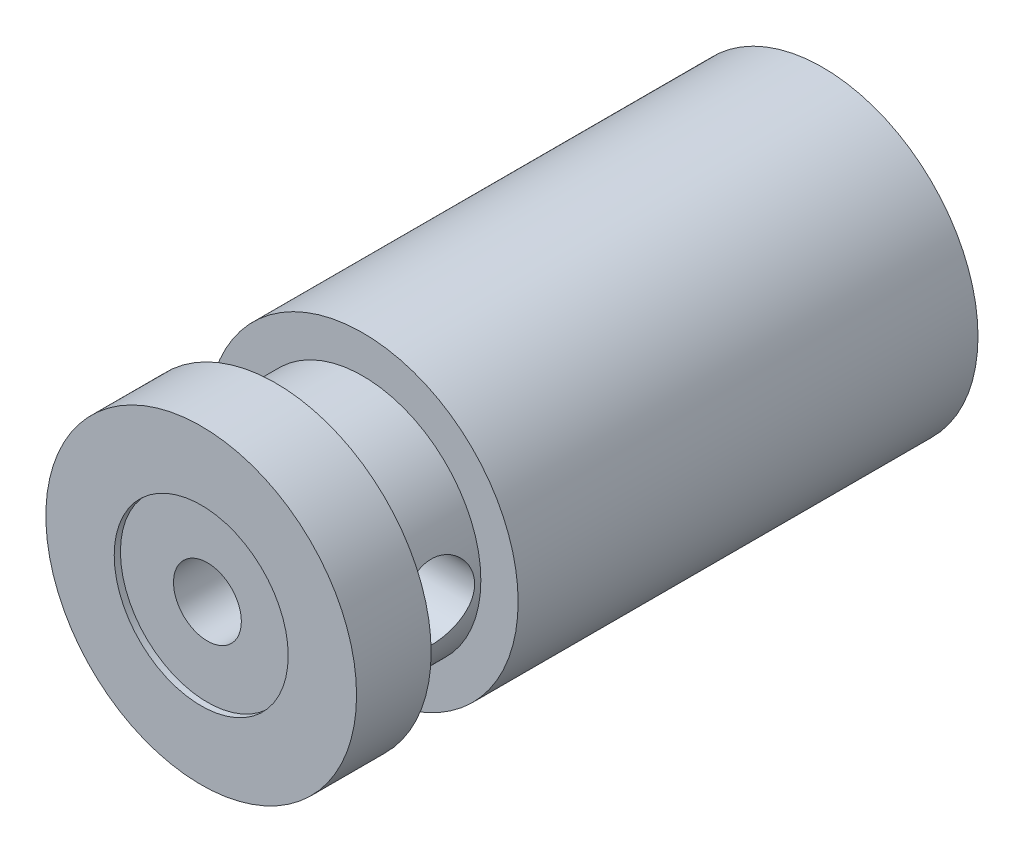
ISO-10303-21;
HEADER;
FILE_DESCRIPTION(('STEP AP214'),'2;1');
FILE_NAME('part.step','',(''),(''),'','','');
FILE_SCHEMA(('AUTOMOTIVE_DESIGN { 1 0 10303 214 1 1 1 1 }'));
ENDSEC;
DATA;
#1=APPLICATION_CONTEXT('core data for automotive mechanical design processes');
#2=APPLICATION_PROTOCOL_DEFINITION('international standard','automotive_design',2000,#1);
#3=PRODUCT_CONTEXT('',#1,'mechanical');
#4=PRODUCT('Part','Part','',(#3));
#5=PRODUCT_RELATED_PRODUCT_CATEGORY('part','',(#4));
#6=PRODUCT_DEFINITION_FORMATION('','',#4);
#7=PRODUCT_DEFINITION_CONTEXT('part definition',#1,'design');
#8=PRODUCT_DEFINITION('design','',#6,#7);
#9=PRODUCT_DEFINITION_SHAPE('','',#8);
#10=(LENGTH_UNIT() NAMED_UNIT(*) SI_UNIT(.MILLI.,.METRE.));
#11=(NAMED_UNIT(*) PLANE_ANGLE_UNIT() SI_UNIT($,.RADIAN.));
#12=(NAMED_UNIT(*) SI_UNIT($,.STERADIAN.) SOLID_ANGLE_UNIT());
#13=UNCERTAINTY_MEASURE_WITH_UNIT(LENGTH_MEASURE(1.E-05),#10,'distance_accuracy_value','');
#14=(GEOMETRIC_REPRESENTATION_CONTEXT(3) GLOBAL_UNCERTAINTY_ASSIGNED_CONTEXT((#13)) GLOBAL_UNIT_ASSIGNED_CONTEXT((#10,
#11,#12)) REPRESENTATION_CONTEXT('',''));
#15=CARTESIAN_POINT('',(0.,0.,0.));
#16=DIRECTION('',(0.,0.,1.));
#17=DIRECTION('',(1.,0.,0.));
#18=AXIS2_PLACEMENT_3D('',#15,#16,#17);
#19=CARTESIAN_POINT('',(0.,0.,50.));
#20=DIRECTION('',(0.,0.,-1.));
#21=DIRECTION('',(-1.,0.,0.));
#22=AXIS2_PLACEMENT_3D('',#19,#20,#21);
#23=CYLINDRICAL_SURFACE('',#22,7.);
#24=CARTESIAN_POINT('',(0.,0.,49.5));
#25=DIRECTION('',(0.,0.,-1.));
#26=DIRECTION('',(-1.,0.,0.));
#27=AXIS2_PLACEMENT_3D('',#24,#25,#26);
#28=CIRCLE('',#27,7.);
#29=CARTESIAN_POINT('',(-7.,0.,49.5));
#30=VERTEX_POINT('',#29);
#31=EDGE_CURVE('E170',#30,#30,#28,.T.);
#32=ORIENTED_EDGE('',*,*,#31,.T.);
#33=EDGE_LOOP('',(#32));
#34=FACE_BOUND('',#33,.T.);
#35=CARTESIAN_POINT('',(0.,0.,50.));
#36=DIRECTION('',(0.,0.,-1.));
#37=DIRECTION('',(-1.,0.,0.));
#38=AXIS2_PLACEMENT_3D('',#35,#36,#37);
#39=CIRCLE('',#38,7.);
#40=CARTESIAN_POINT('',(-7.,0.,50.));
#41=VERTEX_POINT('',#40);
#42=EDGE_CURVE('E20',#41,#41,#39,.F.);
#43=ORIENTED_EDGE('',*,*,#42,.T.);
#44=EDGE_LOOP('',(#43));
#45=FACE_BOUND('',#44,.T.);
#46=ADVANCED_FACE('F16',(#34,#45),#23,.F.);
#47=CARTESIAN_POINT('',(0.,0.,8.0000000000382));
#48=DIRECTION('',(0.,0.,-1.));
#49=DIRECTION('',(-1.,0.,0.));
#50=AXIS2_PLACEMENT_3D('',#47,#48,#49);
#51=CONICAL_SURFACE('',#50,1.62099999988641,1.0297442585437);
#52=CARTESIAN_POINT('',(0.,0.,8.));
#53=DIRECTION('',(0.,0.,-1.));
#54=DIRECTION('',(-1.,0.,0.));
#55=AXIS2_PLACEMENT_3D('',#52,#53,#54);
#56=CIRCLE('',#55,1.621);
#57=CARTESIAN_POINT('',(-1.621,0.,8.));
#58=VERTEX_POINT('',#57);
#59=EDGE_CURVE('E169',#58,#58,#56,.T.);
#60=ORIENTED_EDGE('',*,*,#59,.T.);
#61=EDGE_LOOP('',(#60));
#62=FACE_BOUND('',#61,.T.);
#63=CARTESIAN_POINT('',(-5.6843418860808E-11,0.,8.97399506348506));
#64=VERTEX_POINT('',#63);
#65=VERTEX_LOOP('',#64);
#66=FACE_BOUND('',#65,.T.);
#67=ADVANCED_FACE('F53',(#62,#66),#51,.F.);
#68=CARTESIAN_POINT('',(0.,0.,50.));
#69=DIRECTION('',(0.,0.,-1.));
#70=DIRECTION('',(-1.,0.,0.));
#71=AXIS2_PLACEMENT_3D('',#68,#69,#70);
#72=PLANE('',#71);
#73=CARTESIAN_POINT('',(0.,0.,50.));
#74=DIRECTION('',(0.,0.,1.));
#75=DIRECTION('',(1.,0.,0.));
#76=AXIS2_PLACEMENT_3D('',#73,#74,#75);
#77=CIRCLE('',#76,12.5);
#78=CARTESIAN_POINT('',(12.5,0.,50.));
#79=VERTEX_POINT('',#78);
#80=EDGE_CURVE('E167',#79,#79,#77,.F.);
#81=ORIENTED_EDGE('',*,*,#80,.F.);
#82=EDGE_LOOP('',(#81));
#83=FACE_BOUND('',#82,.T.);
#84=ORIENTED_EDGE('',*,*,#42,.F.);
#85=EDGE_LOOP('',(#84));
#86=FACE_BOUND('',#85,.T.);
#87=ADVANCED_FACE('F55',(#83,#86),#72,.F.);
#88=CARTESIAN_POINT('',(0.,0.,49.5));
#89=DIRECTION('',(0.,0.,-1.));
#90=DIRECTION('',(-1.,0.,0.));
#91=AXIS2_PLACEMENT_3D('',#88,#89,#90);
#92=PLANE('',#91);
#93=ORIENTED_EDGE('',*,*,#31,.F.);
#94=EDGE_LOOP('',(#93));
#95=FACE_BOUND('',#94,.T.);
#96=CARTESIAN_POINT('',(0.,0.,49.5));
#97=DIRECTION('',(0.,0.,1.));
#98=DIRECTION('',(1.,0.,0.));
#99=AXIS2_PLACEMENT_3D('',#96,#97,#98);
#100=CIRCLE('',#99,2.7295);
#101=CARTESIAN_POINT('',(2.7295,0.,49.5));
#102=VERTEX_POINT('',#101);
#103=EDGE_CURVE('E164',#102,#102,#100,.F.);
#104=ORIENTED_EDGE('',*,*,#103,.T.);
#105=EDGE_LOOP('',(#104));
#106=FACE_BOUND('',#105,.T.);
#107=ADVANCED_FACE('F61',(#95,#106),#92,.F.);
#108=CARTESIAN_POINT('',(0.,0.,4.25));
#109=DIRECTION('',(0.,0.,-1.));
#110=DIRECTION('',(-1.,0.,0.));
#111=AXIS2_PLACEMENT_3D('',#108,#109,#110);
#112=CYLINDRICAL_SURFACE('',#111,1.621);
#113=ORIENTED_EDGE('',*,*,#59,.F.);
#114=EDGE_LOOP('',(#113));
#115=FACE_BOUND('',#114,.T.);
#116=CARTESIAN_POINT('',(0.,0.,0.5));
#117=DIRECTION('',(0.,0.,-1.));
#118=DIRECTION('',(-1.,0.,0.));
#119=AXIS2_PLACEMENT_3D('',#116,#117,#118);
#120=CIRCLE('',#119,1.621);
#121=CARTESIAN_POINT('',(-1.621,0.,0.5));
#122=VERTEX_POINT('',#121);
#123=EDGE_CURVE('E153',#122,#122,#120,.T.);
#124=ORIENTED_EDGE('',*,*,#123,.T.);
#125=EDGE_LOOP('',(#124));
#126=FACE_BOUND('',#125,.T.);
#127=ADVANCED_FACE('F191',(#115,#126),#112,.F.);
#128=CARTESIAN_POINT('',(0.,0.,44.));
#129=DIRECTION('',(0.,0.,1.));
#130=DIRECTION('',(1.,0.,0.));
#131=AXIS2_PLACEMENT_3D('',#128,#129,#130);
#132=CYLINDRICAL_SURFACE('',#131,12.5);
#133=ORIENTED_EDGE('',*,*,#80,.T.);
#134=EDGE_LOOP('',(#133));
#135=FACE_BOUND('',#134,.T.);
#136=CARTESIAN_POINT('',(0.,0.,44.));
#137=DIRECTION('',(0.,0.,1.));
#138=DIRECTION('',(1.,0.,0.));
#139=AXIS2_PLACEMENT_3D('',#136,#137,#138);
#140=CIRCLE('',#139,12.5);
#141=CARTESIAN_POINT('',(12.5,0.,44.));
#142=VERTEX_POINT('',#141);
#143=EDGE_CURVE('E151',#142,#142,#140,.F.);
#144=ORIENTED_EDGE('',*,*,#143,.F.);
#145=EDGE_LOOP('',(#144));
#146=FACE_BOUND('',#145,.T.);
#147=ADVANCED_FACE('F188',(#135,#146),#132,.T.);
#148=CARTESIAN_POINT('',(0.,0.,41.9999999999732));
#149=DIRECTION('',(0.,0.,1.));
#150=DIRECTION('',(1.,0.,0.));
#151=AXIS2_PLACEMENT_3D('',#148,#149,#150);
#152=CONICAL_SURFACE('',#151,2.72949999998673,1.02974425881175);
#153=CARTESIAN_POINT('',(0.,0.,42.));
#154=DIRECTION('',(0.,0.,1.));
#155=DIRECTION('',(1.,0.,0.));
#156=AXIS2_PLACEMENT_3D('',#153,#154,#155);
#157=CIRCLE('',#156,2.7295);
#158=CARTESIAN_POINT('',(-0.836761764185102,-2.5980762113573,41.9999999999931));
#159=VERTEX_POINT('',#158);
#160=CARTESIAN_POINT('',(0.83676176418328,-2.59807621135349,41.9999999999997));
#161=VERTEX_POINT('',#160);
#162=EDGE_CURVE('E44',#159,#161,#157,.T.);
#163=ORIENTED_EDGE('',*,*,#162,.T.);
#164=CARTESIAN_POINT('',(0.836761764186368,-2.5980762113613,41.9999999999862));
#165=CARTESIAN_POINT('',(0.775150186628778,-2.60300170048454,41.9914664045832));
#166=CARTESIAN_POINT('',(0.713379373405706,-2.60737971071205,41.9837892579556));
#167=CARTESIAN_POINT('',(0.589566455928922,-2.61504035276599,41.9702467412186));
#168=CARTESIAN_POINT('',(0.527524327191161,-2.61832288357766,41.9643815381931));
#169=CARTESIAN_POINT('',(0.341065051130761,-2.62652602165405,41.9496532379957));
#170=CARTESIAN_POINT('',(0.216328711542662,-2.62980108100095,41.9436593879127));
#171=CARTESIAN_POINT('',(-0.0319170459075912,-2.63193952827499,41.9397562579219));
#172=CARTESIAN_POINT('',(-0.155424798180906,-2.63085124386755,41.9417584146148));
#173=CARTESIAN_POINT('',(-0.40190739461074,-2.62437638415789,41.9535105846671));
#174=CARTESIAN_POINT('',(-0.524882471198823,-2.61899192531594,41.9632567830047));
#175=CARTESIAN_POINT('',(-0.678932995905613,-2.60952300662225,41.9800013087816));
#176=CARTESIAN_POINT('',(-0.710525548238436,-2.60743598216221,41.9836769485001));
#177=CARTESIAN_POINT('',(-0.773679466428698,-2.60297279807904,41.9914936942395));
#178=CARTESIAN_POINT('',(-0.805240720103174,-2.60059622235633,41.9956354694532));
#179=CARTESIAN_POINT('',(-0.836761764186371,-2.59807621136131,41.9999999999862));
#180=B_SPLINE_CURVE_WITH_KNOTS('',3,(#164,#165,#166,#167,#168,#169,#170,#171,#172,#173,#174,
#175,#176,#177,#178,#179),.UNSPECIFIED.,.F.,.F.,(4,2,2,2,2,2,2,4),(0.,0.187167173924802,
0.374351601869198,0.748761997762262,1.11903700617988,1.4891297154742,1.58474945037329,
1.68050825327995),.UNSPECIFIED.);
#181=EDGE_CURVE('E155',#161,#159,#180,.T.);
#182=ORIENTED_EDGE('',*,*,#181,.T.);
#183=EDGE_LOOP('',(#163,#182));
#184=FACE_BOUND('',#183,.T.);
#185=ADVANCED_FACE('F181',(#184),#152,.F.);
#186=CARTESIAN_POINT('',(0.,0.,45.75));
#187=DIRECTION('',(0.,0.,1.));
#188=DIRECTION('',(1.,0.,0.));
#189=AXIS2_PLACEMENT_3D('',#186,#187,#188);
#190=CYLINDRICAL_SURFACE('',#189,2.7295);
#191=ORIENTED_EDGE('',*,*,#103,.F.);
#192=EDGE_LOOP('',(#191));
#193=FACE_BOUND('',#192,.T.);
#194=ORIENTED_EDGE('',*,*,#162,.F.);
#195=CARTESIAN_POINT('',(-0.836761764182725,-2.59807621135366,41.9999999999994));
#196=CARTESIAN_POINT('',(-0.885633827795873,-2.58232501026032,42.0272993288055));
#197=CARTESIAN_POINT('',(-0.933521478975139,-2.5653903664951,42.0556216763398));
#198=CARTESIAN_POINT('',(-1.02747352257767,-2.52923224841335,42.1137347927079));
#199=CARTESIAN_POINT('',(-1.07353888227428,-2.51001001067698,42.1435247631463));
#200=CARTESIAN_POINT('',(-1.16404612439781,-2.46933676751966,42.2040274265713));
#201=CARTESIAN_POINT('',(-1.20848793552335,-2.44788566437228,42.234740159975));
#202=CARTESIAN_POINT('',(-1.29585841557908,-2.40277721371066,42.2967000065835));
#203=CARTESIAN_POINT('',(-1.33878684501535,-2.37911951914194,42.3279472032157));
#204=CARTESIAN_POINT('',(-1.4661870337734,-2.30439364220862,42.422565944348));
#205=CARTESIAN_POINT('',(-1.54846496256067,-2.24993734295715,42.4862597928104));
#206=CARTESIAN_POINT('',(-1.70724092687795,-2.13196408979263,42.6123911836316));
#207=CARTESIAN_POINT('',(-1.7837406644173,-2.06844982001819,42.6748290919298));
#208=CARTESIAN_POINT('',(-1.9098888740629,-1.95132422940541,42.7796159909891));
#209=CARTESIAN_POINT('',(-1.96103427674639,-1.89995774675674,42.8226725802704));
#210=CARTESIAN_POINT('',(-2.05981682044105,-1.79239075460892,42.906657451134));
#211=CARTESIAN_POINT('',(-2.10745444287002,-1.73619091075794,42.9475860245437));
#212=CARTESIAN_POINT('',(-2.24422333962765,-1.56062364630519,43.0659844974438));
#213=CARTESIAN_POINT('',(-2.32769368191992,-1.43384734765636,43.1394740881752));
#214=CARTESIAN_POINT('',(-2.45804831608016,-1.19266839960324,43.2552064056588));
#215=CARTESIAN_POINT('',(-2.50893601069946,-1.08200604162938,43.3007545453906));
#216=CARTESIAN_POINT('',(-2.59639195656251,-0.850947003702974,43.3793592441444));
#217=CARTESIAN_POINT('',(-2.63297571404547,-0.73056103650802,43.4124293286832));
#218=CARTESIAN_POINT('',(-2.6835885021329,-0.508596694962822,43.4582747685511));
#219=CARTESIAN_POINT('',(-2.70072164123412,-0.40829557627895,43.4738366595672));
#220=CARTESIAN_POINT('',(-2.72367978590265,-0.205341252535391,43.4947016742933));
#221=CARTESIAN_POINT('',(-2.72950558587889,-0.102688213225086,43.5000055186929));
#222=CARTESIAN_POINT('',(-2.7294931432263,0.126051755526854,43.4999932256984));
#223=CARTESIAN_POINT('',(-2.72069953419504,0.252156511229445,43.4919862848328));
#224=CARTESIAN_POINT('',(-2.68622166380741,0.50009626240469,43.4606699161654));
#225=CARTESIAN_POINT('',(-2.66052236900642,0.621927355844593,43.4373468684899));
#226=CARTESIAN_POINT('',(-2.59430160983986,0.857094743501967,43.3775042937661));
#227=CARTESIAN_POINT('',(-2.55387475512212,0.970479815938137,43.3410690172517));
#228=CARTESIAN_POINT('',(-2.46045331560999,1.18757370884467,43.2573955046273));
#229=CARTESIAN_POINT('',(-2.40745458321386,1.29127932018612,43.2101537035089));
#230=CARTESIAN_POINT('',(-2.26779005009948,1.5273825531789,43.0867421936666));
#231=CARTESIAN_POINT('',(-2.17612920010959,1.65471411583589,43.0065518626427));
#232=CARTESIAN_POINT('',(-1.97684067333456,1.88838097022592,42.8356044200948));
#233=CARTESIAN_POINT('',(-1.86916865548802,1.99465597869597,42.7448181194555));
#234=CARTESIAN_POINT('',(-1.69638490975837,2.13969079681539,42.6039071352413));
#235=CARTESIAN_POINT('',(-1.63610037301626,2.18611520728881,42.5555254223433));
#236=CARTESIAN_POINT('',(-1.51213781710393,2.27362439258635,42.4582910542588));
#237=CARTESIAN_POINT('',(-1.44846068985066,2.31471056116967,42.4094385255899));
#238=CARTESIAN_POINT('',(-1.31784765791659,2.39147889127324,42.3123595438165));
#239=CARTESIAN_POINT('',(-1.2509220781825,2.42717686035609,42.2641316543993));
#240=CARTESIAN_POINT('',(-1.11337091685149,2.49327023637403,42.16940884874));
#241=CARTESIAN_POINT('',(-1.04274834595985,2.5236698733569,42.1229125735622));
#242=CARTESIAN_POINT('',(-0.948194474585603,2.55961712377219,42.0648038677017));
#243=CARTESIAN_POINT('',(-0.926193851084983,2.56766210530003,42.0515614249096));
#244=CARTESIAN_POINT('',(-0.881787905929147,2.5832487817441,42.0254691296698));
#245=CARTESIAN_POINT('',(-0.859382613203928,2.59079051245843,42.0126192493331));
#246=CARTESIAN_POINT('',(-0.836761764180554,2.59807621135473,41.9999999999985));
#247=B_SPLINE_CURVE_WITH_KNOTS('',3,(#195,#196,#197,#198,#199,#200,#201,#202,#203,#204,#205,
#206,#207,#208,#209,#210,#211,#212,#213,#214,#215,#216,#217,#218,#219,#220,#221,#222,#223,#224,
#225,#226,#227,#228,#229,#230,#231,#232,#233,#234,#235,#236,#237,#238,#239,#240,#241,#242,#243,
#244,#245,#246),.UNSPECIFIED.,.F.,.F.,(4,2,2,2,2,2,2,2,2,2,2,2,2,2,2,2,2,2,2,2,2,2,2,2,2,4),(0.,
0.174392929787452,0.348692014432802,0.522998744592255,0.697332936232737,1.04912860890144,
1.40082025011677,1.65351743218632,1.90617986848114,2.40921711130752,2.79788189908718,
3.1861241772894,3.4938502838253,3.8015547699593,4.17926794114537,4.55731745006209,
4.93298000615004,5.30876667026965,5.83452094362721,6.36175932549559,6.63208387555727,
6.90233770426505,7.17178258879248,7.44101136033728,7.52173095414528,7.60244479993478),.UNSPECIFIED.);
#248=CARTESIAN_POINT('',(-0.83676176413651,2.59807621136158,41.9999999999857));
#249=VERTEX_POINT('',#248);
#250=EDGE_CURVE('E35',#159,#249,#247,.T.);
#251=ORIENTED_EDGE('',*,*,#250,.T.);
#252=CARTESIAN_POINT('',(0.,0.,41.9999999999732));
#253=DIRECTION('',(0.,0.,1.));
#254=DIRECTION('',(1.,0.,0.));
#255=AXIS2_PLACEMENT_3D('',#252,#253,#254);
#256=CIRCLE('',#255,2.72949999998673);
#257=CARTESIAN_POINT('',(0.836761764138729,2.59807621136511,41.9999999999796));
#258=VERTEX_POINT('',#257);
#259=EDGE_CURVE('E158',#249,#258,#256,.F.);
#260=ORIENTED_EDGE('',*,*,#259,.T.);
#261=CARTESIAN_POINT('',(0.836761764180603,2.59807621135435,41.9999999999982));
#262=CARTESIAN_POINT('',(0.885633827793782,2.58232501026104,42.0272993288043));
#263=CARTESIAN_POINT('',(0.933521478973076,2.56539036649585,42.0556216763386));
#264=CARTESIAN_POINT('',(1.02747352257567,2.52923224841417,42.1137347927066));
#265=CARTESIAN_POINT('',(1.0735388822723,2.51001001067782,42.1435247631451));
#266=CARTESIAN_POINT('',(1.16404612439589,2.46933676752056,42.20402742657));
#267=CARTESIAN_POINT('',(1.20848793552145,2.44788566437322,42.2347401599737));
#268=CARTESIAN_POINT('',(1.29585841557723,2.40277721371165,42.2967000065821));
#269=CARTESIAN_POINT('',(1.33878684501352,2.37911951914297,42.3279472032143));
#270=CARTESIAN_POINT('',(1.46618703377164,2.30439364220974,42.4225659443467));
#271=CARTESIAN_POINT('',(1.54846496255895,2.24993734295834,42.4862597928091));
#272=CARTESIAN_POINT('',(1.70724092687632,2.13196408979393,42.6123911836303));
#273=CARTESIAN_POINT('',(1.78374066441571,2.06844982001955,42.6748290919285));
#274=CARTESIAN_POINT('',(1.90988887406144,1.95132422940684,42.7796159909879));
#275=CARTESIAN_POINT('',(1.96103427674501,1.89995774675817,42.8226725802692));
#276=CARTESIAN_POINT('',(2.05981682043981,1.79239075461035,42.9066574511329));
#277=CARTESIAN_POINT('',(2.10745444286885,1.73619091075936,42.9475860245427));
#278=CARTESIAN_POINT('',(2.2442233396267,1.56062364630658,43.065984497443));
#279=CARTESIAN_POINT('',(2.32769368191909,1.43384734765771,43.1394740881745));
#280=CARTESIAN_POINT('',(2.45804831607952,1.19266839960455,43.2552064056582));
#281=CARTESIAN_POINT('',(2.50893601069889,1.0820060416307,43.3007545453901));
#282=CARTESIAN_POINT('',(2.59639195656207,0.850947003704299,43.379359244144));
#283=CARTESIAN_POINT('',(2.6329757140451,0.730561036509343,43.4124293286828));
#284=CARTESIAN_POINT('',(2.68358850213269,0.508596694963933,43.458274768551));
#285=CARTESIAN_POINT('',(2.70072164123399,0.408295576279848,43.4738366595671));
#286=CARTESIAN_POINT('',(2.72367978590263,0.205341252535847,43.4947016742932));
#287=CARTESIAN_POINT('',(2.72950558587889,0.102688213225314,43.5000055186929));
#288=CARTESIAN_POINT('',(2.7294931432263,-0.126051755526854,43.4999932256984));
#289=CARTESIAN_POINT('',(2.72069953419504,-0.252156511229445,43.4919862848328));
#290=CARTESIAN_POINT('',(2.68622166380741,-0.500096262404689,43.4606699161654));
#291=CARTESIAN_POINT('',(2.66052236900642,-0.621927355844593,43.4373468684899));
#292=CARTESIAN_POINT('',(2.59430160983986,-0.857094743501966,43.3775042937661));
#293=CARTESIAN_POINT('',(2.55387475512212,-0.970479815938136,43.3410690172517));
#294=CARTESIAN_POINT('',(2.46045331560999,-1.18757370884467,43.2573955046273));
#295=CARTESIAN_POINT('',(2.40745458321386,-1.29127932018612,43.2101537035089));
#296=CARTESIAN_POINT('',(2.26779005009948,-1.5273825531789,43.0867421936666));
#297=CARTESIAN_POINT('',(2.17612920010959,-1.65471411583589,43.0065518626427));
#298=CARTESIAN_POINT('',(1.97684067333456,-1.88838097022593,42.8356044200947));
#299=CARTESIAN_POINT('',(1.86916865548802,-1.99465597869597,42.7448181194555));
#300=CARTESIAN_POINT('',(1.69638490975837,-2.13969079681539,42.6039071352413));
#301=CARTESIAN_POINT('',(1.63610037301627,-2.18611520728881,42.5555254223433));
#302=CARTESIAN_POINT('',(1.51213781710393,-2.27362439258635,42.4582910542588));
#303=CARTESIAN_POINT('',(1.44846068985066,-2.31471056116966,42.4094385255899));
#304=CARTESIAN_POINT('',(1.31784765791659,-2.39147889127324,42.3123595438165));
#305=CARTESIAN_POINT('',(1.2509220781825,-2.42717686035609,42.2641316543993));
#306=CARTESIAN_POINT('',(1.1133709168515,-2.49327023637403,42.16940884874));
#307=CARTESIAN_POINT('',(1.04274834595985,-2.5236698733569,42.1229125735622));
#308=CARTESIAN_POINT('',(0.94819447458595,-2.55961712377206,42.0648038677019));
#309=CARTESIAN_POINT('',(0.926193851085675,-2.56766210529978,42.05156142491));
#310=CARTESIAN_POINT('',(0.881787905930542,-2.58324878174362,42.0254691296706));
#311=CARTESIAN_POINT('',(0.859382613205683,-2.59079051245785,42.0126192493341));
#312=CARTESIAN_POINT('',(0.836761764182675,-2.59807621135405,41.9999999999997));
#313=B_SPLINE_CURVE_WITH_KNOTS('',3,(#261,#262,#263,#264,#265,#266,#267,#268,#269,#270,#271,
#272,#273,#274,#275,#276,#277,#278,#279,#280,#281,#282,#283,#284,#285,#286,#287,#288,#289,#290,
#291,#292,#293,#294,#295,#296,#297,#298,#299,#300,#301,#302,#303,#304,#305,#306,#307,#308,#309,
#310,#311,#312),.UNSPECIFIED.,.F.,.F.,(4,2,2,2,2,2,2,2,2,2,2,2,2,2,2,2,2,2,2,2,2,2,2,2,2,4),(0.,
0.174392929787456,0.348692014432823,0.522998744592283,0.697332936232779,1.04912860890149,
1.40082025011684,1.65351743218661,1.90617986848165,2.40921711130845,2.79788189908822,
3.18612417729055,3.49385028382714,3.80155476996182,4.17926794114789,4.55731745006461,
4.93298000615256,5.30876667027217,5.83452094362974,6.36175932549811,6.63208387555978,
6.90233770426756,7.171782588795,7.44101136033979,7.52173095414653,7.60244479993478),.UNSPECIFIED.);
#314=EDGE_CURVE('E50',#258,#161,#313,.T.);
#315=ORIENTED_EDGE('',*,*,#314,.T.);
#316=EDGE_LOOP('',(#194,#251,#260,#315));
#317=FACE_BOUND('',#316,.T.);
#318=ADVANCED_FACE('F134',(#193,#317),#190,.F.);
#319=CARTESIAN_POINT('',(0.,0.,41.9999999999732));
#320=DIRECTION('',(0.,0.,1.));
#321=DIRECTION('',(1.,0.,0.));
#322=AXIS2_PLACEMENT_3D('',#319,#320,#321);
#323=CONICAL_SURFACE('',#322,2.72949999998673,1.02974425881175);
#324=ORIENTED_EDGE('',*,*,#259,.F.);
#325=CARTESIAN_POINT('',(-0.836761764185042,2.5980762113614,41.999999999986));
#326=CARTESIAN_POINT('',(-0.775150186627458,2.60300170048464,41.991466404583));
#327=CARTESIAN_POINT('',(-0.713379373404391,2.60737971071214,41.9837892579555));
#328=CARTESIAN_POINT('',(-0.589566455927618,2.61504035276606,41.9702467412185));
#329=CARTESIAN_POINT('',(-0.527524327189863,2.61832288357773,41.964381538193));
#330=CARTESIAN_POINT('',(-0.341065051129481,2.62652602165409,41.9496532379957));
#331=CARTESIAN_POINT('',(-0.216328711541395,2.62980108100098,41.9436593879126));
#332=CARTESIAN_POINT('',(0.0319170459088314,2.63193952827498,41.9397562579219));
#333=CARTESIAN_POINT('',(0.155424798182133,2.63085124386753,41.9417584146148));
#334=CARTESIAN_POINT('',(0.40190739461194,2.62437638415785,41.9535105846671));
#335=CARTESIAN_POINT('',(0.524882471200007,2.61899192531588,41.9632567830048));
#336=CARTESIAN_POINT('',(0.678932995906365,2.6095230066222,41.9800013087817));
#337=CARTESIAN_POINT('',(0.710525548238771,2.60743598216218,41.9836769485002));
#338=CARTESIAN_POINT('',(0.773679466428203,2.60297279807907,41.9914936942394));
#339=CARTESIAN_POINT('',(0.805240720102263,2.6005962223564,41.9956354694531));
#340=CARTESIAN_POINT('',(0.836761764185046,2.59807621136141,41.999999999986));
#341=B_SPLINE_CURVE_WITH_KNOTS('',3,(#325,#326,#327,#328,#329,#330,#331,#332,#333,#334,#335,
#336,#337,#338,#339,#340),.UNSPECIFIED.,.F.,.F.,(4,2,2,2,2,2,2,4),(0.,0.18716717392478,
0.374351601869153,0.748761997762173,1.11903700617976,1.48912971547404,1.58474945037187,
1.68050825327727),.UNSPECIFIED.);
#342=EDGE_CURVE('E117',#249,#258,#341,.T.);
#343=ORIENTED_EDGE('',*,*,#342,.T.);
#344=EDGE_LOOP('',(#324,#343));
#345=FACE_BOUND('',#344,.T.);
#346=ADVANCED_FACE('F129',(#345),#323,.F.);
#347=CARTESIAN_POINT('',(0.,0.,0.5));
#348=DIRECTION('',(0.,0.,1.));
#349=DIRECTION('',(1.,0.,0.));
#350=AXIS2_PLACEMENT_3D('',#347,#348,#349);
#351=PLANE('',#350);
#352=CARTESIAN_POINT('',(0.,0.,0.5));
#353=DIRECTION('',(0.,0.,1.));
#354=DIRECTION('',(1.,0.,0.));
#355=AXIS2_PLACEMENT_3D('',#352,#353,#354);
#356=CIRCLE('',#355,7.);
#357=CARTESIAN_POINT('',(7.,0.,0.5));
#358=VERTEX_POINT('',#357);
#359=EDGE_CURVE('E114',#358,#358,#356,.F.);
#360=ORIENTED_EDGE('',*,*,#359,.T.);
#361=EDGE_LOOP('',(#360));
#362=FACE_BOUND('',#361,.T.);
#363=ORIENTED_EDGE('',*,*,#123,.F.);
#364=EDGE_LOOP('',(#363));
#365=FACE_BOUND('',#364,.T.);
#366=ADVANCED_FACE('F133',(#362,#365),#351,.F.);
#367=CARTESIAN_POINT('',(0.,0.,44.));
#368=DIRECTION('',(0.,0.,-1.));
#369=DIRECTION('',(-1.,0.,0.));
#370=AXIS2_PLACEMENT_3D('',#367,#368,#369);
#371=PLANE('',#370);
#372=CARTESIAN_POINT('',(0.,0.,44.));
#373=DIRECTION('',(0.,0.,1.));
#374=DIRECTION('',(1.,0.,0.));
#375=AXIS2_PLACEMENT_3D('',#372,#373,#374);
#376=CIRCLE('',#375,9.5);
#377=CARTESIAN_POINT('',(9.5,0.,44.));
#378=VERTEX_POINT('',#377);
#379=EDGE_CURVE('E97',#378,#378,#376,.F.);
#380=ORIENTED_EDGE('',*,*,#379,.F.);
#381=EDGE_LOOP('',(#380));
#382=FACE_BOUND('',#381,.T.);
#383=ORIENTED_EDGE('',*,*,#143,.T.);
#384=EDGE_LOOP('',(#383));
#385=FACE_BOUND('',#384,.T.);
#386=ADVANCED_FACE('F139',(#382,#385),#371,.T.);
#387=CARTESIAN_POINT('',(0.,0.,40.5));
#388=DIRECTION('',(1.,0.,0.));
#389=DIRECTION('',(0.,0.,-1.));
#390=AXIS2_PLACEMENT_3D('',#387,#388,#389);
#391=CYLINDRICAL_SURFACE('',#390,3.);
#392=CARTESIAN_POINT('',(9.5,0.,37.5));
#393=CARTESIAN_POINT('',(9.49999511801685,-0.164066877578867,37.5000069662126));
#394=CARTESIAN_POINT('',(9.495706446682,-0.328218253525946,37.5135120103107));
#395=CARTESIAN_POINT('',(9.47900260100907,-0.651790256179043,37.5670637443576));
#396=CARTESIAN_POINT('',(9.46658016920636,-0.811206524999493,37.6071341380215));
#397=CARTESIAN_POINT('',(9.43496933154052,-1.12048354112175,37.7123224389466));
#398=CARTESIAN_POINT('',(9.4157933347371,-1.27036122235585,37.7773944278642));
#399=CARTESIAN_POINT('',(9.37265359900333,-1.5570513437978,37.9305607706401));
#400=CARTESIAN_POINT('',(9.34868981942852,-1.69386367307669,38.0186553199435));
#401=CARTESIAN_POINT('',(9.2976700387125,-1.95487292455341,38.2182844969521));
#402=CARTESIAN_POINT('',(9.27054565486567,-2.0786024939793,38.3304126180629));
#403=CARTESIAN_POINT('',(9.21664882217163,-2.30587471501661,38.5736919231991));
#404=CARTESIAN_POINT('',(9.189876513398,-2.40940954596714,38.704850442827));
#405=CARTESIAN_POINT('',(9.1389734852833,-2.59591411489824,38.9865617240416));
#406=CARTESIAN_POINT('',(9.11492840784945,-2.67828649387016,39.1375265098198));
#407=CARTESIAN_POINT('',(9.07327060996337,-2.81620314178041,39.4519582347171));
#408=CARTESIAN_POINT('',(9.05565003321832,-2.87178020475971,39.6154096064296));
#409=CARTESIAN_POINT('',(9.03308955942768,-2.94179842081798,39.8996827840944));
#410=CARTESIAN_POINT('',(9.02593084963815,-2.96358011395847,40.018570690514));
#411=CARTESIAN_POINT('',(9.01632316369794,-2.9926829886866,40.2582904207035));
#412=CARTESIAN_POINT('',(9.01387382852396,-3.00000527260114,40.3791220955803));
#413=CARTESIAN_POINT('',(9.01388409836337,-2.99999285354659,40.6638372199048));
#414=CARTESIAN_POINT('',(9.0183976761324,-2.98652429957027,40.8277593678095));
#415=CARTESIAN_POINT('',(9.03590055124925,-2.9331307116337,41.150854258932));
#416=CARTESIAN_POINT('',(9.04889770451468,-2.89318115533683,41.3100224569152));
#417=CARTESIAN_POINT('',(9.08174630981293,-2.78834572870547,41.6187731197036));
#418=CARTESIAN_POINT('',(9.10158363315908,-2.72351122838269,41.7683745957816));
#419=CARTESIAN_POINT('',(9.14585867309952,-2.57090557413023,42.0545938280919));
#420=CARTESIAN_POINT('',(9.17029653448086,-2.48313369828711,42.191211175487));
#421=CARTESIAN_POINT('',(9.22198214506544,-2.2838458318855,42.452404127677));
#422=CARTESIAN_POINT('',(9.24929453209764,-2.17166359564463,42.5764587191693));
#423=CARTESIAN_POINT('',(9.30310821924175,-1.92813544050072,42.8043685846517));
#424=CARTESIAN_POINT('',(9.3296092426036,-1.7967830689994,42.9082170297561));
#425=CARTESIAN_POINT('',(9.37955934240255,-1.51486622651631,43.0950813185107));
#426=CARTESIAN_POINT('',(9.40292193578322,-1.36392242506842,43.177549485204));
#427=CARTESIAN_POINT('',(9.44317138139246,-1.0495329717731,43.3156493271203));
#428=CARTESIAN_POINT('',(9.46006588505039,-0.886102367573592,43.3713127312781));
#429=CARTESIAN_POINT('',(9.48166494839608,-0.601608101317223,43.4415465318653));
#430=CARTESIAN_POINT('',(9.48850284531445,-0.482459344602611,43.463423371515));
#431=CARTESIAN_POINT('',(9.49767203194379,-0.242222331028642,43.4926522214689));
#432=CARTESIAN_POINT('',(9.50000360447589,-0.121134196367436,43.5000051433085));
#433=CARTESIAN_POINT('',(9.49999511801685,0.164066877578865,43.4999930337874));
#434=CARTESIAN_POINT('',(9.495706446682,0.328218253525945,43.4864879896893));
#435=CARTESIAN_POINT('',(9.47900260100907,0.651790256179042,43.4329362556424));
#436=CARTESIAN_POINT('',(9.46658016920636,0.811206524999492,43.3928658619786));
#437=CARTESIAN_POINT('',(9.43496933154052,1.12048354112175,43.2876775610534));
#438=CARTESIAN_POINT('',(9.4157933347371,1.27036122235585,43.2226055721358));
#439=CARTESIAN_POINT('',(9.37265359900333,1.5570513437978,43.0694392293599));
#440=CARTESIAN_POINT('',(9.34868981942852,1.69386367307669,42.9813446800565));
#441=CARTESIAN_POINT('',(9.2976700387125,1.95487292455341,42.7817155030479));
#442=CARTESIAN_POINT('',(9.27054565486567,2.07860249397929,42.6695873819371));
#443=CARTESIAN_POINT('',(9.21664882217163,2.30587471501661,42.4263080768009));
#444=CARTESIAN_POINT('',(9.189876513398,2.40940954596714,42.295149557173));
#445=CARTESIAN_POINT('',(9.1389734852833,2.59591411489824,42.0134382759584));
#446=CARTESIAN_POINT('',(9.11492840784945,2.67828649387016,41.8624734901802));
#447=CARTESIAN_POINT('',(9.07327060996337,2.81620314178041,41.5480417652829));
#448=CARTESIAN_POINT('',(9.05565003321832,2.87178020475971,41.3845903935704));
#449=CARTESIAN_POINT('',(9.03308955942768,2.94179842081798,41.1003172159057));
#450=CARTESIAN_POINT('',(9.02593084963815,2.96358011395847,40.981429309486));
#451=CARTESIAN_POINT('',(9.01632316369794,2.9926829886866,40.7417095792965));
#452=CARTESIAN_POINT('',(9.01387382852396,3.00000527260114,40.6208779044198));
#453=CARTESIAN_POINT('',(9.01388409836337,2.99999285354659,40.3361627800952));
#454=CARTESIAN_POINT('',(9.0183976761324,2.98652429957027,40.1722406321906));
#455=CARTESIAN_POINT('',(9.03590055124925,2.9331307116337,39.849145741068));
#456=CARTESIAN_POINT('',(9.04889770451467,2.89318115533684,39.6899775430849));
#457=CARTESIAN_POINT('',(9.08174630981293,2.78834572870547,39.3812268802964));
#458=CARTESIAN_POINT('',(9.10158363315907,2.7235112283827,39.2316254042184));
#459=CARTESIAN_POINT('',(9.14585867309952,2.57090557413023,38.9454061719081));
#460=CARTESIAN_POINT('',(9.17029653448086,2.48313369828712,38.808788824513));
#461=CARTESIAN_POINT('',(9.22198214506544,2.28384583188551,38.547595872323));
#462=CARTESIAN_POINT('',(9.24929453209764,2.17166359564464,38.4235412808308));
#463=CARTESIAN_POINT('',(9.30310821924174,1.92813544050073,38.1956314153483));
#464=CARTESIAN_POINT('',(9.32960924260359,1.79678306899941,38.0917829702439));
#465=CARTESIAN_POINT('',(9.37955934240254,1.51486622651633,37.9049186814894));
#466=CARTESIAN_POINT('',(9.40292193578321,1.36392242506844,37.822450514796));
#467=CARTESIAN_POINT('',(9.44317138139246,1.04953297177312,37.6843506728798));
#468=CARTESIAN_POINT('',(9.46006588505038,0.886102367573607,37.6286872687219));
#469=CARTESIAN_POINT('',(9.48166494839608,0.601608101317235,37.5584534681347));
#470=CARTESIAN_POINT('',(9.48850284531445,0.482459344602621,37.536576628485));
#471=CARTESIAN_POINT('',(9.49767203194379,0.242222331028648,37.5073477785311));
#472=CARTESIAN_POINT('',(9.50000360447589,0.121134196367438,37.4999948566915));
#473=CARTESIAN_POINT('',(9.5,0.,37.5));
#474=B_SPLINE_CURVE_WITH_KNOTS('',3,(#392,#393,#394,#395,#396,#397,#398,#399,#400,#401,#402,
#403,#404,#405,#406,#407,#408,#409,#410,#411,#412,#413,#414,#415,#416,#417,#418,#419,#420,#421,
#422,#423,#424,#425,#426,#427,#428,#429,#430,#431,#432,#433,#434,#435,#436,#437,#438,#439,#440,
#441,#442,#443,#444,#445,#446,#447,#448,#449,#450,#451,#452,#453,#454,#455,#456,#457,#458,#459,
#460,#461,#462,#463,#464,#465,#466,#467,#468,#469,#470,#471,#472,#473),.UNSPECIFIED.,.T.,.F.,(4,
2,2,2,2,2,2,2,2,2,2,2,2,2,2,2,2,2,2,2,2,2,2,2,2,2,2,2,2,2,2,2,2,2,2,2,2,2,2,2,4),(0.,
0.491747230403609,0.983933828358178,1.4752207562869,1.96651185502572,2.47172495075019,
2.97713330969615,3.49553949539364,4.01330959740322,4.37563531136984,4.73793340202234,
5.22899016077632,5.72050229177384,6.21100520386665,6.70152355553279,7.20763880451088,
7.71392480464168,8.2321234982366,8.74970728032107,9.11279790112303,9.47586573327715,
9.96761296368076,10.4597995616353,10.951086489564,11.4423775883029,11.9475906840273,
12.4529990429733,12.9714052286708,13.4891753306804,13.851501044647,14.2137991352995,
14.7048558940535,15.196368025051,15.6868709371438,16.1773892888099,16.683504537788,
17.1897905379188,17.7079892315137,18.2255730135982,18.5886636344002,18.9517314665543),.UNSPECIFIED.);
#475=CARTESIAN_POINT('',(9.5,0.,37.5));
#476=VERTEX_POINT('',#475);
#477=EDGE_CURVE('E109',#476,#476,#474,.T.);
#478=ORIENTED_EDGE('',*,*,#477,.F.);
#479=EDGE_LOOP('',(#478));
#480=FACE_BOUND('',#479,.T.);
#481=CARTESIAN_POINT('',(-9.01387818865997,3.,40.5));
#482=CARTESIAN_POINT('',(-9.01388409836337,2.99999285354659,40.6638372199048));
#483=CARTESIAN_POINT('',(-9.0183976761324,2.98652429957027,40.8277593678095));
#484=CARTESIAN_POINT('',(-9.03590055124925,2.9331307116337,41.150854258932));
#485=CARTESIAN_POINT('',(-9.04889770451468,2.89318115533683,41.3100224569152));
#486=CARTESIAN_POINT('',(-9.08174630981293,2.78834572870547,41.6187731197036));
#487=CARTESIAN_POINT('',(-9.10158363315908,2.72351122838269,41.7683745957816));
#488=CARTESIAN_POINT('',(-9.14585867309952,2.57090557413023,42.0545938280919));
#489=CARTESIAN_POINT('',(-9.17029653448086,2.48313369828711,42.191211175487));
#490=CARTESIAN_POINT('',(-9.22198214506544,2.2838458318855,42.452404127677));
#491=CARTESIAN_POINT('',(-9.24929453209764,2.17166359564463,42.5764587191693));
#492=CARTESIAN_POINT('',(-9.30310821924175,1.92813544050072,42.8043685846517));
#493=CARTESIAN_POINT('',(-9.3296092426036,1.7967830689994,42.9082170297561));
#494=CARTESIAN_POINT('',(-9.37955934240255,1.51486622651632,43.0950813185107));
#495=CARTESIAN_POINT('',(-9.40292193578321,1.36392242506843,43.177549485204));
#496=CARTESIAN_POINT('',(-9.44317138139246,1.0495329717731,43.3156493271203));
#497=CARTESIAN_POINT('',(-9.46006588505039,0.886102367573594,43.3713127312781));
#498=CARTESIAN_POINT('',(-9.48166494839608,0.601608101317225,43.4415465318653));
#499=CARTESIAN_POINT('',(-9.48850284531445,0.482459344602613,43.463423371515));
#500=CARTESIAN_POINT('',(-9.49767203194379,0.242222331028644,43.4926522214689));
#501=CARTESIAN_POINT('',(-9.50000360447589,0.121134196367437,43.5000051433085));
#502=CARTESIAN_POINT('',(-9.49999511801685,-0.164066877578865,43.4999930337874));
#503=CARTESIAN_POINT('',(-9.495706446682,-0.328218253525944,43.4864879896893));
#504=CARTESIAN_POINT('',(-9.47900260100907,-0.651790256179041,43.4329362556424));
#505=CARTESIAN_POINT('',(-9.46658016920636,-0.811206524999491,43.3928658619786));
#506=CARTESIAN_POINT('',(-9.43496933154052,-1.12048354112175,43.2876775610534));
#507=CARTESIAN_POINT('',(-9.4157933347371,-1.27036122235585,43.2226055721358));
#508=CARTESIAN_POINT('',(-9.37265359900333,-1.5570513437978,43.0694392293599));
#509=CARTESIAN_POINT('',(-9.34868981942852,-1.69386367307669,42.9813446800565));
#510=CARTESIAN_POINT('',(-9.2976700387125,-1.95487292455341,42.7817155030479));
#511=CARTESIAN_POINT('',(-9.27054565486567,-2.07860249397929,42.6695873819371));
#512=CARTESIAN_POINT('',(-9.21664882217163,-2.30587471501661,42.4263080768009));
#513=CARTESIAN_POINT('',(-9.189876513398,-2.40940954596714,42.295149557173));
#514=CARTESIAN_POINT('',(-9.13897348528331,-2.59591411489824,42.0134382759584));
#515=CARTESIAN_POINT('',(-9.11492840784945,-2.67828649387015,41.8624734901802));
#516=CARTESIAN_POINT('',(-9.07327060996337,-2.81620314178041,41.5480417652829));
#517=CARTESIAN_POINT('',(-9.05565003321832,-2.8717802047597,41.3845903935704));
#518=CARTESIAN_POINT('',(-9.03308955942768,-2.94179842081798,41.1003172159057));
#519=CARTESIAN_POINT('',(-9.02593084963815,-2.96358011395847,40.981429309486));
#520=CARTESIAN_POINT('',(-9.01632316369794,-2.9926829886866,40.7417095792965));
#521=CARTESIAN_POINT('',(-9.01387382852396,-3.00000527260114,40.6208779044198));
#522=CARTESIAN_POINT('',(-9.01388409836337,-2.99999285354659,40.3361627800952));
#523=CARTESIAN_POINT('',(-9.0183976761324,-2.98652429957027,40.1722406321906));
#524=CARTESIAN_POINT('',(-9.03590055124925,-2.9331307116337,39.849145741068));
#525=CARTESIAN_POINT('',(-9.04889770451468,-2.89318115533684,39.6899775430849));
#526=CARTESIAN_POINT('',(-9.08174630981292,-2.78834572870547,39.3812268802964));
#527=CARTESIAN_POINT('',(-9.10158363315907,-2.7235112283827,39.2316254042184));
#528=CARTESIAN_POINT('',(-9.14585867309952,-2.57090557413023,38.9454061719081));
#529=CARTESIAN_POINT('',(-9.17029653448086,-2.48313369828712,38.808788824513));
#530=CARTESIAN_POINT('',(-9.22198214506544,-2.28384583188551,38.547595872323));
#531=CARTESIAN_POINT('',(-9.24929453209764,-2.17166359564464,38.4235412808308));
#532=CARTESIAN_POINT('',(-9.30310821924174,-1.92813544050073,38.1956314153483));
#533=CARTESIAN_POINT('',(-9.32960924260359,-1.79678306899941,38.0917829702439));
#534=CARTESIAN_POINT('',(-9.37955934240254,-1.51486622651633,37.9049186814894));
#535=CARTESIAN_POINT('',(-9.40292193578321,-1.36392242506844,37.822450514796));
#536=CARTESIAN_POINT('',(-9.44317138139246,-1.04953297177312,37.6843506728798));
#537=CARTESIAN_POINT('',(-9.46006588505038,-0.886102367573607,37.6286872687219));
#538=CARTESIAN_POINT('',(-9.48166494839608,-0.601608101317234,37.5584534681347));
#539=CARTESIAN_POINT('',(-9.48850284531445,-0.48245934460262,37.536576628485));
#540=CARTESIAN_POINT('',(-9.49767203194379,-0.242222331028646,37.5073477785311));
#541=CARTESIAN_POINT('',(-9.50000360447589,-0.121134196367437,37.4999948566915));
#542=CARTESIAN_POINT('',(-9.49999511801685,0.164066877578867,37.5000069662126));
#543=CARTESIAN_POINT('',(-9.495706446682,0.328218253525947,37.5135120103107));
#544=CARTESIAN_POINT('',(-9.47900260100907,0.651790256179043,37.5670637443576));
#545=CARTESIAN_POINT('',(-9.46658016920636,0.811206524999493,37.6071341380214));
#546=CARTESIAN_POINT('',(-9.43496933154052,1.12048354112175,37.7123224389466));
#547=CARTESIAN_POINT('',(-9.4157933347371,1.27036122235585,37.7773944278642));
#548=CARTESIAN_POINT('',(-9.37265359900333,1.5570513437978,37.9305607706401));
#549=CARTESIAN_POINT('',(-9.34868981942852,1.69386367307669,38.0186553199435));
#550=CARTESIAN_POINT('',(-9.2976700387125,1.95487292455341,38.2182844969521));
#551=CARTESIAN_POINT('',(-9.27054565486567,2.07860249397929,38.3304126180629));
#552=CARTESIAN_POINT('',(-9.21664882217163,2.30587471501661,38.5736919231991));
#553=CARTESIAN_POINT('',(-9.189876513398,2.40940954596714,38.704850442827));
#554=CARTESIAN_POINT('',(-9.1389734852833,2.59591411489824,38.9865617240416));
#555=CARTESIAN_POINT('',(-9.11492840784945,2.67828649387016,39.1375265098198));
#556=CARTESIAN_POINT('',(-9.07327060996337,2.81620314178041,39.4519582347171));
#557=CARTESIAN_POINT('',(-9.05565003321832,2.87178020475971,39.6154096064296));
#558=CARTESIAN_POINT('',(-9.03308955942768,2.94179842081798,39.8996827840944));
#559=CARTESIAN_POINT('',(-9.02593084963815,2.96358011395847,40.018570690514));
#560=CARTESIAN_POINT('',(-9.01632316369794,2.9926829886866,40.2582904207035));
#561=CARTESIAN_POINT('',(-9.01387382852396,3.00000527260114,40.3791220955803));
#562=CARTESIAN_POINT('',(-9.01387818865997,3.,40.5));
#563=B_SPLINE_CURVE_WITH_KNOTS('',3,(#481,#482,#483,#484,#485,#486,#487,#488,#489,#490,#491,
#492,#493,#494,#495,#496,#497,#498,#499,#500,#501,#502,#503,#504,#505,#506,#507,#508,#509,#510,
#511,#512,#513,#514,#515,#516,#517,#518,#519,#520,#521,#522,#523,#524,#525,#526,#527,#528,#529,
#530,#531,#532,#533,#534,#535,#536,#537,#538,#539,#540,#541,#542,#543,#544,#545,#546,#547,#548,
#549,#550,#551,#552,#553,#554,#555,#556,#557,#558,#559,#560,#561,#562),.UNSPECIFIED.,.T.,.F.,(4,
2,2,2,2,2,2,2,2,2,2,2,2,2,2,2,2,2,2,2,2,2,2,2,2,2,2,2,2,2,2,2,2,2,2,2,2,2,2,2,4),(0.,
0.491056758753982,0.982568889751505,1.47307180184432,1.96359015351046,2.46970540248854,
2.97599140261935,3.49419009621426,4.01177387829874,4.3748644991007,4.73793233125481,
5.22967956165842,5.72186615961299,6.21315308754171,6.70444418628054,7.209657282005,
7.71506564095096,8.23347182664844,8.75124192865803,9.11356764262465,9.47586573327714,
9.96692249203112,10.4584346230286,10.9489375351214,11.4394558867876,11.9455711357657,
12.4518571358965,12.9700558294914,13.4876396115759,13.8507302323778,14.213798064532,
14.7055452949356,15.1977318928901,15.6890188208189,16.1803099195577,16.6855230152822,
17.1909313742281,17.7093375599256,18.2271076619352,18.5894333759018,18.9517314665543),.UNSPECIFIED.);
#564=CARTESIAN_POINT('',(-9.01387818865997,3.,40.5));
#565=VERTEX_POINT('',#564);
#566=EDGE_CURVE('E88',#565,#565,#563,.T.);
#567=ORIENTED_EDGE('',*,*,#566,.F.);
#568=EDGE_LOOP('',(#567));
#569=FACE_BOUND('',#568,.T.);
#570=ORIENTED_EDGE('',*,*,#250,.F.);
#571=ORIENTED_EDGE('',*,*,#181,.F.);
#572=ORIENTED_EDGE('',*,*,#314,.F.);
#573=ORIENTED_EDGE('',*,*,#342,.F.);
#574=EDGE_LOOP('',(#570,#571,#572,#573));
#575=FACE_BOUND('',#574,.T.);
#576=ADVANCED_FACE('F99',(#480,#569,#575),#391,.F.);
#577=CARTESIAN_POINT('',(0.,0.,0.));
#578=DIRECTION('',(0.,0.,1.));
#579=DIRECTION('',(1.,0.,0.));
#580=AXIS2_PLACEMENT_3D('',#577,#578,#579);
#581=CYLINDRICAL_SURFACE('',#580,7.);
#582=ORIENTED_EDGE('',*,*,#359,.F.);
#583=EDGE_LOOP('',(#582));
#584=FACE_BOUND('',#583,.T.);
#585=CARTESIAN_POINT('',(0.,0.,0.));
#586=DIRECTION('',(0.,0.,1.));
#587=DIRECTION('',(1.,0.,0.));
#588=AXIS2_PLACEMENT_3D('',#585,#586,#587);
#589=CIRCLE('',#588,7.);
#590=CARTESIAN_POINT('',(7.,0.,0.));
#591=VERTEX_POINT('',#590);
#592=EDGE_CURVE('E84',#591,#591,#589,.T.);
#593=ORIENTED_EDGE('',*,*,#592,.F.);
#594=EDGE_LOOP('',(#593));
#595=FACE_BOUND('',#594,.T.);
#596=ADVANCED_FACE('F107',(#584,#595),#581,.F.);
#597=CARTESIAN_POINT('',(0.,0.,37.));
#598=DIRECTION('',(0.,0.,1.));
#599=DIRECTION('',(1.,0.,0.));
#600=AXIS2_PLACEMENT_3D('',#597,#598,#599);
#601=CYLINDRICAL_SURFACE('',#600,9.5);
#602=CARTESIAN_POINT('',(0.,0.,37.));
#603=DIRECTION('',(0.,0.,1.));
#604=DIRECTION('',(1.,0.,0.));
#605=AXIS2_PLACEMENT_3D('',#602,#603,#604);
#606=CIRCLE('',#605,9.5);
#607=CARTESIAN_POINT('',(9.5,0.,37.));
#608=VERTEX_POINT('',#607);
#609=EDGE_CURVE('E82',#608,#608,#606,.T.);
#610=ORIENTED_EDGE('',*,*,#609,.T.);
#611=EDGE_LOOP('',(#610));
#612=FACE_BOUND('',#611,.T.);
#613=ORIENTED_EDGE('',*,*,#477,.T.);
#614=EDGE_LOOP('',(#613));
#615=FACE_BOUND('',#614,.T.);
#616=ORIENTED_EDGE('',*,*,#379,.T.);
#617=EDGE_LOOP('',(#616));
#618=FACE_BOUND('',#617,.T.);
#619=ORIENTED_EDGE('',*,*,#566,.T.);
#620=EDGE_LOOP('',(#619));
#621=FACE_BOUND('',#620,.T.);
#622=ADVANCED_FACE('F103',(#612,#615,#618,#621),#601,.T.);
#623=CARTESIAN_POINT('',(0.,0.,0.));
#624=DIRECTION('',(0.,0.,-1.));
#625=DIRECTION('',(-1.,0.,0.));
#626=AXIS2_PLACEMENT_3D('',#623,#624,#625);
#627=PLANE('',#626);
#628=CARTESIAN_POINT('',(0.,0.,0.));
#629=DIRECTION('',(0.,0.,1.));
#630=DIRECTION('',(1.,0.,0.));
#631=AXIS2_PLACEMENT_3D('',#628,#629,#630);
#632=CIRCLE('',#631,12.5);
#633=CARTESIAN_POINT('',(12.5,0.,0.));
#634=VERTEX_POINT('',#633);
#635=EDGE_CURVE('E26',#634,#634,#632,.T.);
#636=ORIENTED_EDGE('',*,*,#635,.F.);
#637=EDGE_LOOP('',(#636));
#638=FACE_BOUND('',#637,.T.);
#639=ORIENTED_EDGE('',*,*,#592,.T.);
#640=EDGE_LOOP('',(#639));
#641=FACE_BOUND('',#640,.T.);
#642=ADVANCED_FACE('F73',(#638,#641),#627,.T.);
#643=CARTESIAN_POINT('',(0.,0.,37.));
#644=DIRECTION('',(0.,0.,-1.));
#645=DIRECTION('',(-1.,0.,0.));
#646=AXIS2_PLACEMENT_3D('',#643,#644,#645);
#647=PLANE('',#646);
#648=CARTESIAN_POINT('',(0.,0.,37.));
#649=DIRECTION('',(0.,0.,1.));
#650=DIRECTION('',(1.,0.,0.));
#651=AXIS2_PLACEMENT_3D('',#648,#649,#650);
#652=CIRCLE('',#651,12.5);
#653=CARTESIAN_POINT('',(12.5,0.,37.));
#654=VERTEX_POINT('',#653);
#655=EDGE_CURVE('E10',#654,#654,#652,.F.);
#656=ORIENTED_EDGE('',*,*,#655,.F.);
#657=EDGE_LOOP('',(#656));
#658=FACE_BOUND('',#657,.T.);
#659=ORIENTED_EDGE('',*,*,#609,.F.);
#660=EDGE_LOOP('',(#659));
#661=FACE_BOUND('',#660,.T.);
#662=ADVANCED_FACE('F69',(#658,#661),#647,.F.);
#663=CARTESIAN_POINT('',(0.,0.,0.));
#664=DIRECTION('',(0.,0.,1.));
#665=DIRECTION('',(1.,0.,0.));
#666=AXIS2_PLACEMENT_3D('',#663,#664,#665);
#667=CYLINDRICAL_SURFACE('',#666,12.5);
#668=ORIENTED_EDGE('',*,*,#635,.T.);
#669=EDGE_LOOP('',(#668));
#670=FACE_BOUND('',#669,.T.);
#671=ORIENTED_EDGE('',*,*,#655,.T.);
#672=EDGE_LOOP('',(#671));
#673=FACE_BOUND('',#672,.T.);
#674=ADVANCED_FACE('F18',(#670,#673),#667,.T.);
#675=CLOSED_SHELL('',(#46,#67,#87,#107,#127,#147,#185,#318,#346,#366,#386,#576,#596,#622,#642,
#662,#674));
#676=MANIFOLD_SOLID_BREP('B1',#675);
#677=ADVANCED_BREP_SHAPE_REPRESENTATION('',(#18,#676),#14);
#678=SHAPE_DEFINITION_REPRESENTATION(#9,#677);
ENDSEC;
END-ISO-10303-21;
